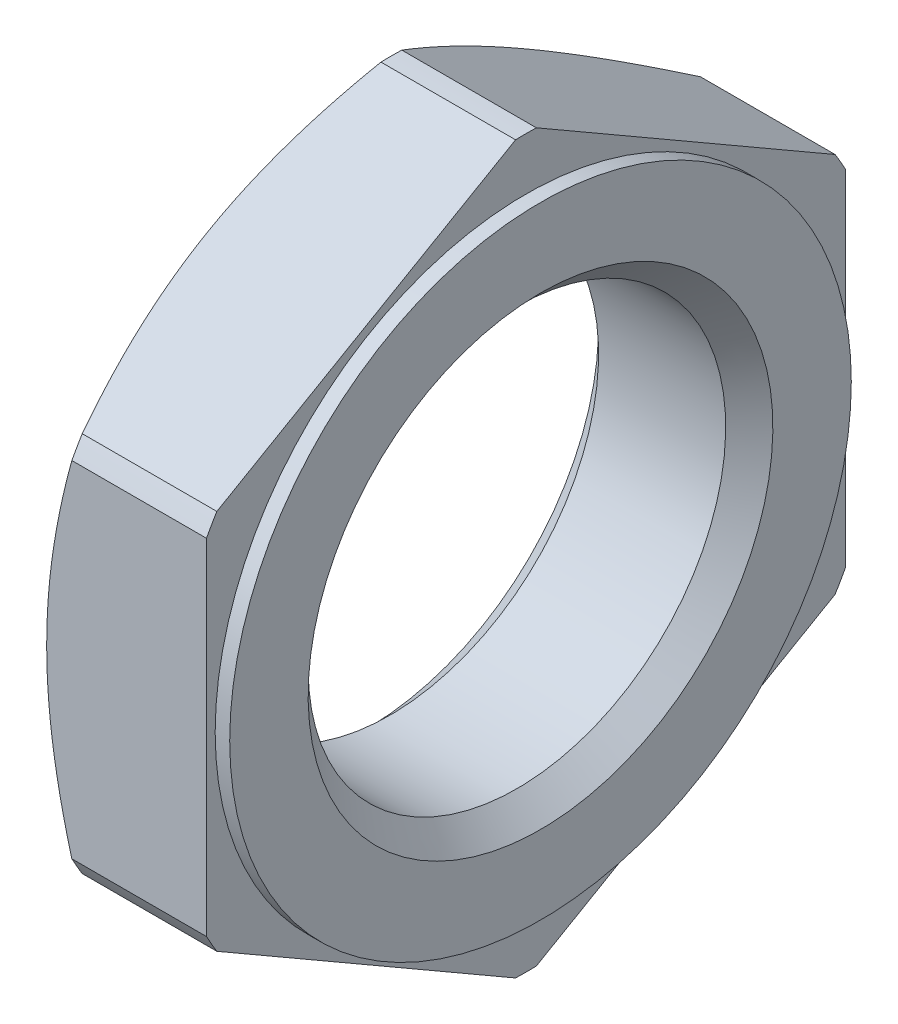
ISO-10303-21;
HEADER;
FILE_DESCRIPTION(('STEP AP214'),'2;1');
FILE_NAME('part.step','',(''),(''),'','','');
FILE_SCHEMA(('AUTOMOTIVE_DESIGN { 1 0 10303 214 1 1 1 1 }'));
ENDSEC;
DATA;
#1=APPLICATION_CONTEXT('core data for automotive mechanical design processes');
#2=APPLICATION_PROTOCOL_DEFINITION('international standard','automotive_design',2000,#1);
#3=PRODUCT_CONTEXT('',#1,'mechanical');
#4=PRODUCT('Part','Part','',(#3));
#5=PRODUCT_RELATED_PRODUCT_CATEGORY('part','',(#4));
#6=PRODUCT_DEFINITION_FORMATION('','',#4);
#7=PRODUCT_DEFINITION_CONTEXT('part definition',#1,'design');
#8=PRODUCT_DEFINITION('design','',#6,#7);
#9=PRODUCT_DEFINITION_SHAPE('','',#8);
#10=(LENGTH_UNIT() NAMED_UNIT(*) SI_UNIT(.MILLI.,.METRE.));
#11=(NAMED_UNIT(*) PLANE_ANGLE_UNIT() SI_UNIT($,.RADIAN.));
#12=(NAMED_UNIT(*) SI_UNIT($,.STERADIAN.) SOLID_ANGLE_UNIT());
#13=UNCERTAINTY_MEASURE_WITH_UNIT(LENGTH_MEASURE(1.E-05),#10,'distance_accuracy_value','');
#14=(GEOMETRIC_REPRESENTATION_CONTEXT(3) GLOBAL_UNCERTAINTY_ASSIGNED_CONTEXT((#13)) GLOBAL_UNIT_ASSIGNED_CONTEXT((#10,
#11,#12)) REPRESENTATION_CONTEXT('',''));
#15=CARTESIAN_POINT('',(0.,0.,0.));
#16=DIRECTION('',(0.,0.,1.));
#17=DIRECTION('',(1.,0.,0.));
#18=AXIS2_PLACEMENT_3D('',#15,#16,#17);
#19=CARTESIAN_POINT('',(6.,0.,0.));
#20=DIRECTION('',(-1.,0.,0.));
#21=DIRECTION('',(0.,0.,1.));
#22=AXIS2_PLACEMENT_3D('',#19,#20,#21);
#23=CYLINDRICAL_SURFACE('',#22,10.7);
#24=CARTESIAN_POINT('',(5.5,0.,0.));
#25=DIRECTION('',(-1.,0.,0.));
#26=DIRECTION('',(0.,0.,1.));
#27=AXIS2_PLACEMENT_3D('',#24,#25,#26);
#28=CIRCLE('',#27,10.7);
#29=CARTESIAN_POINT('',(5.5,0.,10.7));
#30=VERTEX_POINT('',#29);
#31=EDGE_CURVE('E382',#30,#30,#28,.F.);
#32=ORIENTED_EDGE('',*,*,#31,.T.);
#33=EDGE_LOOP('',(#32));
#34=FACE_BOUND('',#33,.T.);
#35=CARTESIAN_POINT('',(6.,0.,0.));
#36=DIRECTION('',(-1.,0.,0.));
#37=DIRECTION('',(0.,0.,1.));
#38=AXIS2_PLACEMENT_3D('',#35,#36,#37);
#39=CIRCLE('',#38,10.7);
#40=CARTESIAN_POINT('',(6.,0.,10.7));
#41=VERTEX_POINT('',#40);
#42=EDGE_CURVE('E20',#41,#41,#39,.T.);
#43=ORIENTED_EDGE('',*,*,#42,.T.);
#44=EDGE_LOOP('',(#43));
#45=FACE_BOUND('',#44,.T.);
#46=ADVANCED_FACE('F17',(#34,#45),#23,.T.);
#47=CARTESIAN_POINT('',(6.,10.7,0.));
#48=DIRECTION('',(-1.,0.,0.));
#49=DIRECTION('',(0.,0.,1.));
#50=AXIS2_PLACEMENT_3D('',#47,#48,#49);
#51=PLANE('',#50);
#52=CARTESIAN_POINT('',(6.,0.,0.));
#53=DIRECTION('',(1.,0.,0.));
#54=DIRECTION('',(0.,1.,0.));
#55=AXIS2_PLACEMENT_3D('',#52,#53,#54);
#56=CIRCLE('',#55,8.);
#57=CARTESIAN_POINT('',(6.,8.,0.));
#58=VERTEX_POINT('',#57);
#59=EDGE_CURVE('E377',#58,#58,#56,.F.);
#60=ORIENTED_EDGE('',*,*,#59,.T.);
#61=EDGE_LOOP('',(#60));
#62=FACE_BOUND('',#61,.T.);
#63=ORIENTED_EDGE('',*,*,#42,.F.);
#64=EDGE_LOOP('',(#63));
#65=FACE_BOUND('',#64,.T.);
#66=ADVANCED_FACE('F325',(#62,#65),#51,.F.);
#67=CARTESIAN_POINT('',(6.,0.,0.));
#68=DIRECTION('',(-1.,0.,0.));
#69=DIRECTION('',(0.,0.,1.));
#70=AXIS2_PLACEMENT_3D('',#67,#68,#69);
#71=CYLINDRICAL_SURFACE('',#70,12.5);
#72=CARTESIAN_POINT('',(0.866025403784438,0.,0.));
#73=DIRECTION('',(-1.,0.,0.));
#74=DIRECTION('',(0.,0.,1.));
#75=AXIS2_PLACEMENT_3D('',#72,#73,#74);
#76=CIRCLE('',#75,12.5);
#77=CARTESIAN_POINT('',(0.866025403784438,-12.4948649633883,0.358259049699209));
#78=VERTEX_POINT('',#77);
#79=CARTESIAN_POINT('',(0.866025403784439,-12.4948649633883,-0.35825904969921));
#80=VERTEX_POINT('',#79);
#81=EDGE_CURVE('E153',#78,#80,#76,.F.);
#82=ORIENTED_EDGE('',*,*,#81,.T.);
#83=DIRECTION('',(1.,0.,0.));
#84=VECTOR('',#83,1.);
#85=CARTESIAN_POINT('',(6.,-12.4948649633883,-0.358259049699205));
#86=LINE('',#85,#84);
#87=CARTESIAN_POINT('',(5.5,-12.4948649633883,-0.35825904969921));
#88=VERTEX_POINT('',#87);
#89=EDGE_CURVE('E156',#80,#88,#86,.T.);
#90=ORIENTED_EDGE('',*,*,#89,.T.);
#91=CARTESIAN_POINT('',(5.5,0.,0.));
#92=DIRECTION('',(-1.,0.,0.));
#93=DIRECTION('',(0.,0.,1.));
#94=AXIS2_PLACEMENT_3D('',#91,#92,#93);
#95=CIRCLE('',#94,12.5);
#96=CARTESIAN_POINT('',(5.5,-12.4948649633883,0.358259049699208));
#97=VERTEX_POINT('',#96);
#98=EDGE_CURVE('E389',#88,#97,#95,.T.);
#99=ORIENTED_EDGE('',*,*,#98,.T.);
#100=DIRECTION('',(1.,0.,0.));
#101=VECTOR('',#100,1.);
#102=CARTESIAN_POINT('',(6.,-12.4948649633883,0.358259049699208));
#103=LINE('',#102,#101);
#104=EDGE_CURVE('E160',#97,#78,#103,.F.);
#105=ORIENTED_EDGE('',*,*,#104,.T.);
#106=EDGE_LOOP('',(#82,#90,#99,#105));
#107=FACE_BOUND('',#106,.T.);
#108=ADVANCED_FACE('F322',(#107),#71,.T.);
#109=CARTESIAN_POINT('',(6.,0.,0.));
#110=DIRECTION('',(-1.,0.,0.));
#111=DIRECTION('',(0.,0.,1.));
#112=AXIS2_PLACEMENT_3D('',#109,#110,#111);
#113=CYLINDRICAL_SURFACE('',#112,12.5);
#114=CARTESIAN_POINT('',(0.866025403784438,0.,0.));
#115=DIRECTION('',(-1.,0.,0.));
#116=DIRECTION('',(0.,0.,1.));
#117=AXIS2_PLACEMENT_3D('',#114,#115,#116);
#118=CIRCLE('',#117,12.5);
#119=CARTESIAN_POINT('',(0.866025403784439,-6.55769391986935,-10.6417409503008));
#120=VERTEX_POINT('',#119);
#121=CARTESIAN_POINT('',(0.866025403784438,-5.93717104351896,-11.));
#122=VERTEX_POINT('',#121);
#123=EDGE_CURVE('E151',#120,#122,#118,.F.);
#124=ORIENTED_EDGE('',*,*,#123,.T.);
#125=DIRECTION('',(1.,0.,0.));
#126=VECTOR('',#125,1.);
#127=CARTESIAN_POINT('',(6.,-5.93717104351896,-11.));
#128=LINE('',#127,#126);
#129=CARTESIAN_POINT('',(5.5,-5.93717104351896,-11.));
#130=VERTEX_POINT('',#129);
#131=EDGE_CURVE('E143',#122,#130,#128,.T.);
#132=ORIENTED_EDGE('',*,*,#131,.T.);
#133=CARTESIAN_POINT('',(5.5,0.,0.));
#134=DIRECTION('',(-1.,0.,0.));
#135=DIRECTION('',(0.,0.,1.));
#136=AXIS2_PLACEMENT_3D('',#133,#134,#135);
#137=CIRCLE('',#136,12.5);
#138=CARTESIAN_POINT('',(5.5,-6.55769391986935,-10.6417409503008));
#139=VERTEX_POINT('',#138);
#140=EDGE_CURVE('E129',#130,#139,#137,.T.);
#141=ORIENTED_EDGE('',*,*,#140,.T.);
#142=DIRECTION('',(1.,0.,0.));
#143=VECTOR('',#142,1.);
#144=CARTESIAN_POINT('',(6.,-6.55769391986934,-10.6417409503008));
#145=LINE('',#144,#143);
#146=EDGE_CURVE('E145',#139,#120,#145,.F.);
#147=ORIENTED_EDGE('',*,*,#146,.T.);
#148=EDGE_LOOP('',(#124,#132,#141,#147));
#149=FACE_BOUND('',#148,.T.);
#150=ADVANCED_FACE('F319',(#149),#113,.T.);
#151=CARTESIAN_POINT('',(6.,0.,0.));
#152=DIRECTION('',(-1.,0.,0.));
#153=DIRECTION('',(0.,0.,1.));
#154=AXIS2_PLACEMENT_3D('',#151,#152,#153);
#155=CYLINDRICAL_SURFACE('',#154,12.5);
#156=CARTESIAN_POINT('',(0.866025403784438,0.,0.));
#157=DIRECTION('',(-1.,0.,0.));
#158=DIRECTION('',(0.,0.,1.));
#159=AXIS2_PLACEMENT_3D('',#156,#157,#158);
#160=CIRCLE('',#159,12.5);
#161=CARTESIAN_POINT('',(0.866025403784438,5.93717104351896,-11.));
#162=VERTEX_POINT('',#161);
#163=CARTESIAN_POINT('',(0.866025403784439,6.55769391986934,-10.6417409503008));
#164=VERTEX_POINT('',#163);
#165=EDGE_CURVE('E149',#162,#164,#160,.F.);
#166=ORIENTED_EDGE('',*,*,#165,.T.);
#167=DIRECTION('',(1.,0.,0.));
#168=VECTOR('',#167,1.);
#169=CARTESIAN_POINT('',(6.,6.55769391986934,-10.6417409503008));
#170=LINE('',#169,#168);
#171=CARTESIAN_POINT('',(5.5,6.55769391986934,-10.6417409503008));
#172=VERTEX_POINT('',#171);
#173=EDGE_CURVE('E128',#164,#172,#170,.T.);
#174=ORIENTED_EDGE('',*,*,#173,.T.);
#175=CARTESIAN_POINT('',(5.5,0.,0.));
#176=DIRECTION('',(-1.,0.,0.));
#177=DIRECTION('',(0.,0.,1.));
#178=AXIS2_PLACEMENT_3D('',#175,#176,#177);
#179=CIRCLE('',#178,12.5);
#180=CARTESIAN_POINT('',(5.5,5.93717104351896,-11.));
#181=VERTEX_POINT('',#180);
#182=EDGE_CURVE('E118',#172,#181,#179,.T.);
#183=ORIENTED_EDGE('',*,*,#182,.T.);
#184=DIRECTION('',(1.,0.,0.));
#185=VECTOR('',#184,1.);
#186=CARTESIAN_POINT('',(6.,5.93717104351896,-11.));
#187=LINE('',#186,#185);
#188=EDGE_CURVE('E125',#181,#162,#187,.F.);
#189=ORIENTED_EDGE('',*,*,#188,.T.);
#190=EDGE_LOOP('',(#166,#174,#183,#189));
#191=FACE_BOUND('',#190,.T.);
#192=ADVANCED_FACE('F124',(#191),#155,.T.);
#193=CARTESIAN_POINT('',(6.,0.,0.));
#194=DIRECTION('',(-1.,0.,0.));
#195=DIRECTION('',(0.,0.,1.));
#196=AXIS2_PLACEMENT_3D('',#193,#194,#195);
#197=CYLINDRICAL_SURFACE('',#196,12.5);
#198=CARTESIAN_POINT('',(5.5,0.,0.));
#199=DIRECTION('',(-1.,0.,0.));
#200=DIRECTION('',(0.,0.,1.));
#201=AXIS2_PLACEMENT_3D('',#198,#199,#200);
#202=CIRCLE('',#201,12.5);
#203=CARTESIAN_POINT('',(5.5,12.4948649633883,0.35825904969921));
#204=VERTEX_POINT('',#203);
#205=CARTESIAN_POINT('',(5.5,12.4948649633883,-0.358259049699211));
#206=VERTEX_POINT('',#205);
#207=EDGE_CURVE('E385',#204,#206,#202,.T.);
#208=ORIENTED_EDGE('',*,*,#207,.T.);
#209=DIRECTION('',(1.,0.,0.));
#210=VECTOR('',#209,1.);
#211=CARTESIAN_POINT('',(6.,12.4948649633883,-0.358259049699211));
#212=LINE('',#211,#210);
#213=CARTESIAN_POINT('',(0.866025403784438,12.4948649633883,-0.358259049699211));
#214=VERTEX_POINT('',#213);
#215=EDGE_CURVE('E414',#206,#214,#212,.F.);
#216=ORIENTED_EDGE('',*,*,#215,.T.);
#217=CARTESIAN_POINT('',(0.866025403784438,0.,0.));
#218=DIRECTION('',(-1.,0.,0.));
#219=DIRECTION('',(0.,0.,1.));
#220=AXIS2_PLACEMENT_3D('',#217,#218,#219);
#221=CIRCLE('',#220,12.5);
#222=CARTESIAN_POINT('',(0.866025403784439,12.4948649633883,0.35825904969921));
#223=VERTEX_POINT('',#222);
#224=EDGE_CURVE('E408',#214,#223,#221,.F.);
#225=ORIENTED_EDGE('',*,*,#224,.T.);
#226=DIRECTION('',(1.,0.,0.));
#227=VECTOR('',#226,1.);
#228=CARTESIAN_POINT('',(6.,12.4948649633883,0.358259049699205));
#229=LINE('',#228,#227);
#230=EDGE_CURVE('E412',#223,#204,#229,.T.);
#231=ORIENTED_EDGE('',*,*,#230,.T.);
#232=EDGE_LOOP('',(#208,#216,#225,#231));
#233=FACE_BOUND('',#232,.T.);
#234=ADVANCED_FACE('F312',(#233),#197,.T.);
#235=CARTESIAN_POINT('',(6.,0.,0.));
#236=DIRECTION('',(-1.,0.,0.));
#237=DIRECTION('',(0.,0.,1.));
#238=AXIS2_PLACEMENT_3D('',#235,#236,#237);
#239=CYLINDRICAL_SURFACE('',#238,12.5);
#240=CARTESIAN_POINT('',(0.866025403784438,0.,0.));
#241=DIRECTION('',(-1.,0.,0.));
#242=DIRECTION('',(0.,0.,1.));
#243=AXIS2_PLACEMENT_3D('',#240,#241,#242);
#244=CIRCLE('',#243,12.5);
#245=CARTESIAN_POINT('',(0.866025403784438,6.55769391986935,10.6417409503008));
#246=VERTEX_POINT('',#245);
#247=CARTESIAN_POINT('',(0.866025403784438,5.93717104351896,11.));
#248=VERTEX_POINT('',#247);
#249=EDGE_CURVE('E130',#246,#248,#244,.F.);
#250=ORIENTED_EDGE('',*,*,#249,.T.);
#251=DIRECTION('',(-1.,0.,0.));
#252=VECTOR('',#251,1.);
#253=CARTESIAN_POINT('',(6.,5.93717104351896,11.));
#254=LINE('',#253,#252);
#255=CARTESIAN_POINT('',(5.5,5.93717104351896,11.));
#256=VERTEX_POINT('',#255);
#257=EDGE_CURVE('E405',#248,#256,#254,.F.);
#258=ORIENTED_EDGE('',*,*,#257,.T.);
#259=CARTESIAN_POINT('',(5.5,0.,0.));
#260=DIRECTION('',(-1.,0.,0.));
#261=DIRECTION('',(0.,0.,1.));
#262=AXIS2_PLACEMENT_3D('',#259,#260,#261);
#263=CIRCLE('',#262,12.5);
#264=CARTESIAN_POINT('',(5.5,6.55769391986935,10.6417409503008));
#265=VERTEX_POINT('',#264);
#266=EDGE_CURVE('E387',#256,#265,#263,.T.);
#267=ORIENTED_EDGE('',*,*,#266,.T.);
#268=DIRECTION('',(1.,0.,0.));
#269=VECTOR('',#268,1.);
#270=CARTESIAN_POINT('',(6.,6.55769391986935,10.6417409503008));
#271=LINE('',#270,#269);
#272=EDGE_CURVE('E411',#265,#246,#271,.F.);
#273=ORIENTED_EDGE('',*,*,#272,.T.);
#274=EDGE_LOOP('',(#250,#258,#267,#273));
#275=FACE_BOUND('',#274,.T.);
#276=ADVANCED_FACE('F308',(#275),#239,.T.);
#277=CARTESIAN_POINT('',(5.5,12.5,0.));
#278=DIRECTION('',(-1.,0.,0.));
#279=DIRECTION('',(0.,0.,1.));
#280=AXIS2_PLACEMENT_3D('',#277,#278,#279);
#281=PLANE('',#280);
#282=ORIENTED_EDGE('',*,*,#31,.F.);
#283=EDGE_LOOP('',(#282));
#284=FACE_BOUND('',#283,.T.);
#285=DIRECTION('',(0.,0.5,-0.866025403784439));
#286=VECTOR('',#285,1.);
#287=CARTESIAN_POINT('',(5.5,12.7017059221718,0.));
#288=LINE('',#287,#286);
#289=EDGE_CURVE('E409',#204,#265,#288,.F.);
#290=ORIENTED_EDGE('',*,*,#289,.T.);
#291=ORIENTED_EDGE('',*,*,#266,.F.);
#292=DIRECTION('',(0.,1.,0.));
#293=VECTOR('',#292,1.);
#294=CARTESIAN_POINT('',(5.5,6.35085296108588,11.));
#295=LINE('',#294,#293);
#296=CARTESIAN_POINT('',(5.5,-5.93717104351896,11.));
#297=VERTEX_POINT('',#296);
#298=EDGE_CURVE('E402',#256,#297,#295,.F.);
#299=ORIENTED_EDGE('',*,*,#298,.T.);
#300=CARTESIAN_POINT('',(5.5,0.,0.));
#301=DIRECTION('',(-1.,0.,0.));
#302=DIRECTION('',(0.,0.,1.));
#303=AXIS2_PLACEMENT_3D('',#300,#301,#302);
#304=CIRCLE('',#303,12.5);
#305=CARTESIAN_POINT('',(5.5,-6.55769391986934,10.6417409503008));
#306=VERTEX_POINT('',#305);
#307=EDGE_CURVE('E380',#306,#297,#304,.T.);
#308=ORIENTED_EDGE('',*,*,#307,.F.);
#309=DIRECTION('',(0.,0.5,0.866025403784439));
#310=VECTOR('',#309,1.);
#311=CARTESIAN_POINT('',(5.5,-6.35085296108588,11.));
#312=LINE('',#311,#310);
#313=EDGE_CURVE('E158',#306,#97,#312,.F.);
#314=ORIENTED_EDGE('',*,*,#313,.T.);
#315=ORIENTED_EDGE('',*,*,#98,.F.);
#316=DIRECTION('',(0.,-0.5,0.866025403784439));
#317=VECTOR('',#316,1.);
#318=CARTESIAN_POINT('',(5.5,-12.7017059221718,0.));
#319=LINE('',#318,#317);
#320=EDGE_CURVE('E154',#88,#139,#319,.F.);
#321=ORIENTED_EDGE('',*,*,#320,.T.);
#322=ORIENTED_EDGE('',*,*,#140,.F.);
#323=DIRECTION('',(0.,1.,0.));
#324=VECTOR('',#323,1.);
#325=CARTESIAN_POINT('',(5.5,-6.35085296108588,-11.));
#326=LINE('',#325,#324);
#327=EDGE_CURVE('E135',#130,#181,#326,.T.);
#328=ORIENTED_EDGE('',*,*,#327,.T.);
#329=ORIENTED_EDGE('',*,*,#182,.F.);
#330=DIRECTION('',(0.,-0.5,-0.866025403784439));
#331=VECTOR('',#330,1.);
#332=CARTESIAN_POINT('',(5.5,6.35085296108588,-11.));
#333=LINE('',#332,#331);
#334=EDGE_CURVE('E413',#172,#206,#333,.F.);
#335=ORIENTED_EDGE('',*,*,#334,.T.);
#336=ORIENTED_EDGE('',*,*,#207,.F.);
#337=EDGE_LOOP('',(#290,#291,#299,#308,#314,#315,#321,#322,#328,#329,#335,#336));
#338=FACE_BOUND('',#337,.T.);
#339=ADVANCED_FACE('F141',(#284,#338),#281,.F.);
#340=CARTESIAN_POINT('',(6.,0.,0.));
#341=DIRECTION('',(-1.,0.,0.));
#342=DIRECTION('',(0.,0.,1.));
#343=AXIS2_PLACEMENT_3D('',#340,#341,#342);
#344=CYLINDRICAL_SURFACE('',#343,12.5);
#345=CARTESIAN_POINT('',(0.866025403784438,0.,0.));
#346=DIRECTION('',(-1.,0.,0.));
#347=DIRECTION('',(0.,0.,1.));
#348=AXIS2_PLACEMENT_3D('',#345,#346,#347);
#349=CIRCLE('',#348,12.5);
#350=CARTESIAN_POINT('',(0.866025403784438,-5.93717104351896,11.));
#351=VERTEX_POINT('',#350);
#352=CARTESIAN_POINT('',(0.866025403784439,-6.55769391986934,10.6417409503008));
#353=VERTEX_POINT('',#352);
#354=EDGE_CURVE('E379',#351,#353,#349,.F.);
#355=ORIENTED_EDGE('',*,*,#354,.T.);
#356=DIRECTION('',(1.,0.,0.));
#357=VECTOR('',#356,1.);
#358=CARTESIAN_POINT('',(6.,-6.55769391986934,10.6417409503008));
#359=LINE('',#358,#357);
#360=EDGE_CURVE('E161',#353,#306,#359,.T.);
#361=ORIENTED_EDGE('',*,*,#360,.T.);
#362=ORIENTED_EDGE('',*,*,#307,.T.);
#363=DIRECTION('',(-1.,0.,0.));
#364=VECTOR('',#363,1.);
#365=CARTESIAN_POINT('',(6.,-5.93717104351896,11.));
#366=LINE('',#365,#364);
#367=EDGE_CURVE('E371',#297,#351,#366,.T.);
#368=ORIENTED_EDGE('',*,*,#367,.T.);
#369=EDGE_LOOP('',(#355,#361,#362,#368));
#370=FACE_BOUND('',#369,.T.);
#371=ADVANCED_FACE('F301',(#370),#344,.T.);
#372=CARTESIAN_POINT('',(6.,0.,0.));
#373=DIRECTION('',(1.,0.,0.));
#374=DIRECTION('',(0.,1.,0.));
#375=AXIS2_PLACEMENT_3D('',#372,#373,#374);
#376=CONICAL_SURFACE('',#375,8.,0.785398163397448);
#377=CARTESIAN_POINT('',(5.188,0.,0.));
#378=DIRECTION('',(-1.,0.,0.));
#379=DIRECTION('',(0.,0.,1.));
#380=AXIS2_PLACEMENT_3D('',#377,#378,#379);
#381=CIRCLE('',#380,7.188);
#382=CARTESIAN_POINT('',(5.188,0.,7.188));
#383=VERTEX_POINT('',#382);
#384=EDGE_CURVE('E368',#383,#383,#381,.T.);
#385=ORIENTED_EDGE('',*,*,#384,.T.);
#386=EDGE_LOOP('',(#385));
#387=FACE_BOUND('',#386,.T.);
#388=ORIENTED_EDGE('',*,*,#59,.F.);
#389=EDGE_LOOP('',(#388));
#390=FACE_BOUND('',#389,.T.);
#391=ADVANCED_FACE('F296',(#387,#390),#376,.F.);
#392=CARTESIAN_POINT('',(6.,-6.35085296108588,11.));
#393=DIRECTION('',(0.,0.866025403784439,-0.5));
#394=DIRECTION('',(0.,0.5,0.866025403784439));
#395=AXIS2_PLACEMENT_3D('',#392,#393,#394);
#396=PLANE('',#395);
#397=ORIENTED_EDGE('',*,*,#313,.F.);
#398=ORIENTED_EDGE('',*,*,#360,.F.);
#399=CARTESIAN_POINT('',(0.,-9.52627944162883,5.49999999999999));
#400=CARTESIAN_POINT('',(-3.41932240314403E-05,-9.40053234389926,5.71780036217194));
#401=CARTESIAN_POINT('',(0.00497877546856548,-9.27479037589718,5.93559183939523));
#402=CARTESIAN_POINT('',(0.0248453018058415,-9.02351913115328,6.37080640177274));
#403=CARTESIAN_POINT('',(0.0396973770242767,-8.89798982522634,6.58822953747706));
#404=CARTESIAN_POINT('',(0.078899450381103,-8.64787663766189,7.02143828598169));
#405=CARTESIAN_POINT('',(0.103206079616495,-8.52329104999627,7.23722685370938));
#406=CARTESIAN_POINT('',(0.160853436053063,-8.27464923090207,7.66788711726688));
#407=CARTESIAN_POINT('',(0.194194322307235,-8.15059300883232,7.88275879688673));
#408=CARTESIAN_POINT('',(0.306868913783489,-7.7796315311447,8.52528292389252));
#409=CARTESIAN_POINT('',(0.398898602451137,-7.53366639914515,8.95130702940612));
#410=CARTESIAN_POINT('',(0.558591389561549,-7.16655690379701,9.58715932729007));
#411=CARTESIAN_POINT('',(0.615593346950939,-7.04420210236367,9.79908405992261));
#412=CARTESIAN_POINT('',(0.736100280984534,-6.80033131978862,10.2214806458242));
#413=CARTESIAN_POINT('',(0.799603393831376,-6.67881510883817,10.4319528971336));
#414=CARTESIAN_POINT('',(0.866025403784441,-6.55769391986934,10.6417409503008));
#415=B_SPLINE_CURVE_WITH_KNOTS('',3,(#399,#400,#401,#402,#403,#404,#405,#406,#407,#408,#409,
#410,#411,#412,#413,#414),.UNSPECIFIED.,.F.,.F.,(4,2,2,2,2,2,2,4),(0.,0.754415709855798,
1.50871778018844,2.25959984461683,3.01049512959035,4.51068137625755,5.26440004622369,
6.01790323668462),.UNSPECIFIED.);
#416=CARTESIAN_POINT('',(0.,-9.52627944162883,5.49999999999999));
#417=VERTEX_POINT('',#416);
#418=EDGE_CURVE('E287',#417,#353,#415,.T.);
#419=ORIENTED_EDGE('',*,*,#418,.F.);
#420=CARTESIAN_POINT('',(0.866025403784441,-12.4948649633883,0.358259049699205));
#421=CARTESIAN_POINT('',(0.799603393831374,-12.3737437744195,0.568047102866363));
#422=CARTESIAN_POINT('',(0.736100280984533,-12.252227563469,0.778519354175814));
#423=CARTESIAN_POINT('',(0.615593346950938,-12.008356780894,1.20091594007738));
#424=CARTESIAN_POINT('',(0.558591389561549,-11.8860019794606,1.41284067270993));
#425=CARTESIAN_POINT('',(0.398898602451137,-11.5188924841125,2.04869297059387));
#426=CARTESIAN_POINT('',(0.306868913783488,-11.2729273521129,2.47471707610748));
#427=CARTESIAN_POINT('',(0.194194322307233,-10.9019658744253,3.11724120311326));
#428=CARTESIAN_POINT('',(0.160853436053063,-10.7779096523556,3.33211288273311));
#429=CARTESIAN_POINT('',(0.103206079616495,-10.5292678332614,3.76277314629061));
#430=CARTESIAN_POINT('',(0.0788994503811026,-10.4046822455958,3.9785617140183));
#431=CARTESIAN_POINT('',(0.0396973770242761,-10.1545690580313,4.41177046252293));
#432=CARTESIAN_POINT('',(0.0248453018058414,-10.0290397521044,4.62919359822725));
#433=CARTESIAN_POINT('',(0.00497877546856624,-9.77776850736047,5.06440816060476));
#434=CARTESIAN_POINT('',(-3.41932240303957E-05,-9.6520265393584,5.28219963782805));
#435=CARTESIAN_POINT('',(0.,-9.52627944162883,5.49999999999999));
#436=B_SPLINE_CURVE_WITH_KNOTS('',3,(#420,#421,#422,#423,#424,#425,#426,#427,#428,#429,#430,
#431,#432,#433,#434,#435),.UNSPECIFIED.,.F.,.F.,(4,2,2,2,2,2,2,4),(0.,0.753503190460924,
1.50722186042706,3.00740810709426,3.75830339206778,4.50918545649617,5.26348752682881,
6.01790323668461),.UNSPECIFIED.);
#437=EDGE_CURVE('E282',#78,#417,#436,.T.);
#438=ORIENTED_EDGE('',*,*,#437,.F.);
#439=ORIENTED_EDGE('',*,*,#104,.F.);
#440=EDGE_LOOP('',(#397,#398,#419,#438,#439));
#441=FACE_BOUND('',#440,.T.);
#442=ADVANCED_FACE('F292',(#441),#396,.F.);
#443=CARTESIAN_POINT('',(6.,-12.7017059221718,0.));
#444=DIRECTION('',(0.,0.866025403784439,0.5));
#445=DIRECTION('',(0.,-0.5,0.866025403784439));
#446=AXIS2_PLACEMENT_3D('',#443,#444,#445);
#447=PLANE('',#446);
#448=ORIENTED_EDGE('',*,*,#320,.F.);
#449=ORIENTED_EDGE('',*,*,#89,.F.);
#450=CARTESIAN_POINT('',(0.,-9.52627944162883,-5.49999999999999));
#451=CARTESIAN_POINT('',(-3.41932240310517E-05,-9.6520265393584,-5.28219963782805));
#452=CARTESIAN_POINT('',(0.00497877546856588,-9.77776850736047,-5.06440816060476));
#453=CARTESIAN_POINT('',(0.0248453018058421,-10.0290397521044,-4.62919359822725));
#454=CARTESIAN_POINT('',(0.0396973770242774,-10.1545690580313,-4.41177046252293));
#455=CARTESIAN_POINT('',(0.0788994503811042,-10.4046822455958,-3.9785617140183));
#456=CARTESIAN_POINT('',(0.103206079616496,-10.5292678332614,-3.76277314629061));
#457=CARTESIAN_POINT('',(0.160853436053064,-10.7779096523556,-3.33211288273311));
#458=CARTESIAN_POINT('',(0.194194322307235,-10.9019658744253,-3.11724120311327));
#459=CARTESIAN_POINT('',(0.306868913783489,-11.2729273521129,-2.47471707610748));
#460=CARTESIAN_POINT('',(0.398898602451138,-11.5188924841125,-2.04869297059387));
#461=CARTESIAN_POINT('',(0.55859138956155,-11.8860019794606,-1.41284067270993));
#462=CARTESIAN_POINT('',(0.615593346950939,-12.008356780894,-1.20091594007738));
#463=CARTESIAN_POINT('',(0.736100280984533,-12.252227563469,-0.778519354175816));
#464=CARTESIAN_POINT('',(0.799603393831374,-12.3737437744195,-0.568047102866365));
#465=CARTESIAN_POINT('',(0.866025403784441,-12.4948649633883,-0.358259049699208));
#466=B_SPLINE_CURVE_WITH_KNOTS('',3,(#450,#451,#452,#453,#454,#455,#456,#457,#458,#459,#460,
#461,#462,#463,#464,#465),.UNSPECIFIED.,.F.,.F.,(4,2,2,2,2,2,2,4),(0.,0.754415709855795,
1.50871778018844,2.25959984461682,3.01049512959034,4.51068137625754,5.26440004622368,
6.01790323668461),.UNSPECIFIED.);
#467=CARTESIAN_POINT('',(0.,-9.52627944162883,-5.49999999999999));
#468=VERTEX_POINT('',#467);
#469=EDGE_CURVE('E277',#468,#80,#466,.T.);
#470=ORIENTED_EDGE('',*,*,#469,.F.);
#471=CARTESIAN_POINT('',(0.866025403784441,-6.55769391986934,-10.6417409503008));
#472=CARTESIAN_POINT('',(0.799603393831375,-6.67881510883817,-10.4319528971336));
#473=CARTESIAN_POINT('',(0.736100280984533,-6.80033131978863,-10.2214806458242));
#474=CARTESIAN_POINT('',(0.615593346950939,-7.04420210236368,-9.79908405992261));
#475=CARTESIAN_POINT('',(0.55859138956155,-7.16655690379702,-9.58715932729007));
#476=CARTESIAN_POINT('',(0.398898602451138,-7.53366639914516,-8.95130702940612));
#477=CARTESIAN_POINT('',(0.306868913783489,-7.77963153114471,-8.52528292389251));
#478=CARTESIAN_POINT('',(0.194194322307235,-8.15059300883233,-7.88275879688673));
#479=CARTESIAN_POINT('',(0.160853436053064,-8.27464923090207,-7.66788711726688));
#480=CARTESIAN_POINT('',(0.103206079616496,-8.52329104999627,-7.23722685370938));
#481=CARTESIAN_POINT('',(0.0788994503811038,-8.6478766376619,-7.02143828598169));
#482=CARTESIAN_POINT('',(0.0396973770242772,-8.89798982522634,-6.58822953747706));
#483=CARTESIAN_POINT('',(0.0248453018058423,-9.02351913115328,-6.37080640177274));
#484=CARTESIAN_POINT('',(0.00497877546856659,-9.27479037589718,-5.93559183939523));
#485=CARTESIAN_POINT('',(-3.41932240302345E-05,-9.40053234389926,-5.71780036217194));
#486=CARTESIAN_POINT('',(0.,-9.52627944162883,-5.49999999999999));
#487=B_SPLINE_CURVE_WITH_KNOTS('',3,(#471,#472,#473,#474,#475,#476,#477,#478,#479,#480,#481,
#482,#483,#484,#485,#486),.UNSPECIFIED.,.F.,.F.,(4,2,2,2,2,2,2,4),(0.,0.753503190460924,
1.50722186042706,3.00740810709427,3.75830339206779,4.50918545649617,5.26348752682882,
6.01790323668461),.UNSPECIFIED.);
#488=EDGE_CURVE('E258',#120,#468,#487,.T.);
#489=ORIENTED_EDGE('',*,*,#488,.F.);
#490=ORIENTED_EDGE('',*,*,#146,.F.);
#491=EDGE_LOOP('',(#448,#449,#470,#489,#490));
#492=FACE_BOUND('',#491,.T.);
#493=ADVANCED_FACE('F244',(#492),#447,.F.);
#494=CARTESIAN_POINT('',(6.,-6.35085296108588,-11.));
#495=DIRECTION('',(0.,0.,1.));
#496=DIRECTION('',(1.,0.,0.));
#497=AXIS2_PLACEMENT_3D('',#494,#495,#496);
#498=PLANE('',#497);
#499=ORIENTED_EDGE('',*,*,#327,.F.);
#500=ORIENTED_EDGE('',*,*,#131,.F.);
#501=CARTESIAN_POINT('',(0.,0.,-11.));
#502=CARTESIAN_POINT('',(-3.4193224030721E-05,-0.251494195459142,-11.));
#503=CARTESIAN_POINT('',(0.00497877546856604,-0.502978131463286,-11.));
#504=CARTESIAN_POINT('',(0.0248453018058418,-1.00552062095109,-11.));
#505=CARTESIAN_POINT('',(0.0396973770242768,-1.25657923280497,-11.));
#506=CARTESIAN_POINT('',(0.0788994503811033,-1.75680560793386,-11.));
#507=CARTESIAN_POINT('',(0.103206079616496,-2.00597678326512,-11.));
#508=CARTESIAN_POINT('',(0.160853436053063,-2.50326042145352,-11.));
#509=CARTESIAN_POINT('',(0.194194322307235,-2.751372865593,-11.));
#510=CARTESIAN_POINT('',(0.306868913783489,-3.49329582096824,-11.));
#511=CARTESIAN_POINT('',(0.398898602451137,-3.98522608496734,-11.));
#512=CARTESIAN_POINT('',(0.558591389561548,-4.71944507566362,-11.));
#513=CARTESIAN_POINT('',(0.615593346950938,-4.9641546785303,-11.));
#514=CARTESIAN_POINT('',(0.736100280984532,-5.45189624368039,-11.));
#515=CARTESIAN_POINT('',(0.799603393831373,-5.69492866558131,-11.));
#516=CARTESIAN_POINT('',(0.866025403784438,-5.93717104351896,-11.));
#517=B_SPLINE_CURVE_WITH_KNOTS('',3,(#501,#502,#503,#504,#505,#506,#507,#508,#509,#510,#511,
#512,#513,#514,#515,#516),.UNSPECIFIED.,.F.,.F.,(4,2,2,2,2,2,2,4),(0.,0.754415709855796,
1.50871778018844,2.25959984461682,3.01049512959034,4.51068137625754,5.26440004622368,
6.0179032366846),.UNSPECIFIED.);
#518=CARTESIAN_POINT('',(0.,0.,-11.));
#519=VERTEX_POINT('',#518);
#520=EDGE_CURVE('E252',#519,#122,#517,.T.);
#521=ORIENTED_EDGE('',*,*,#520,.F.);
#522=CARTESIAN_POINT('',(0.866025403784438,5.93717104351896,-11.));
#523=CARTESIAN_POINT('',(0.799603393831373,5.69492866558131,-11.));
#524=CARTESIAN_POINT('',(0.736100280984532,5.45189624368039,-11.));
#525=CARTESIAN_POINT('',(0.615593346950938,4.9641546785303,-11.));
#526=CARTESIAN_POINT('',(0.558591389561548,4.71944507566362,-11.));
#527=CARTESIAN_POINT('',(0.398898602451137,3.98522608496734,-11.));
#528=CARTESIAN_POINT('',(0.306868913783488,3.49329582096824,-11.));
#529=CARTESIAN_POINT('',(0.194194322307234,2.751372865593,-11.));
#530=CARTESIAN_POINT('',(0.160853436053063,2.50326042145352,-11.));
#531=CARTESIAN_POINT('',(0.103206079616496,2.00597678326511,-11.));
#532=CARTESIAN_POINT('',(0.0788994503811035,1.75680560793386,-11.));
#533=CARTESIAN_POINT('',(0.039697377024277,1.25657923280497,-11.));
#534=CARTESIAN_POINT('',(0.0248453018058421,1.00552062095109,-11.));
#535=CARTESIAN_POINT('',(0.00497877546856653,0.502978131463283,-11.));
#536=CARTESIAN_POINT('',(-3.41932240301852E-05,0.251494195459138,-11.));
#537=CARTESIAN_POINT('',(0.,0.,-11.));
#538=B_SPLINE_CURVE_WITH_KNOTS('',3,(#522,#523,#524,#525,#526,#527,#528,#529,#530,#531,#532,
#533,#534,#535,#536,#537),.UNSPECIFIED.,.F.,.F.,(4,2,2,2,2,2,2,4),(0.,0.753503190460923,
1.50722186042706,3.00740810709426,3.75830339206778,4.50918545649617,5.26348752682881,
6.01790323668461),.UNSPECIFIED.);
#539=EDGE_CURVE('E138',#162,#519,#538,.T.);
#540=ORIENTED_EDGE('',*,*,#539,.F.);
#541=ORIENTED_EDGE('',*,*,#188,.F.);
#542=EDGE_LOOP('',(#499,#500,#521,#540,#541));
#543=FACE_BOUND('',#542,.T.);
#544=ADVANCED_FACE('F133',(#543),#498,.F.);
#545=CARTESIAN_POINT('',(6.,6.35085296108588,-11.));
#546=DIRECTION('',(0.,-0.866025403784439,0.5));
#547=DIRECTION('',(0.,-0.5,-0.866025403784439));
#548=AXIS2_PLACEMENT_3D('',#545,#546,#547);
#549=PLANE('',#548);
#550=ORIENTED_EDGE('',*,*,#334,.F.);
#551=ORIENTED_EDGE('',*,*,#173,.F.);
#552=CARTESIAN_POINT('',(0.,9.52627944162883,-5.5));
#553=CARTESIAN_POINT('',(-3.41932240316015E-05,9.40053234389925,-5.71780036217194));
#554=CARTESIAN_POINT('',(0.004978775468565,9.27479037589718,-5.93559183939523));
#555=CARTESIAN_POINT('',(0.0248453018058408,9.02351913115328,-6.37080640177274));
#556=CARTESIAN_POINT('',(0.039697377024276,8.89798982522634,-6.58822953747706));
#557=CARTESIAN_POINT('',(0.0788994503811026,8.64787663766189,-7.02143828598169));
#558=CARTESIAN_POINT('',(0.103206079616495,8.52329104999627,-7.23722685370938));
#559=CARTESIAN_POINT('',(0.160853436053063,8.27464923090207,-7.66788711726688));
#560=CARTESIAN_POINT('',(0.194194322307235,8.15059300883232,-7.88275879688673));
#561=CARTESIAN_POINT('',(0.30686891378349,7.7796315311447,-8.52528292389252));
#562=CARTESIAN_POINT('',(0.398898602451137,7.53366639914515,-8.95130702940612));
#563=CARTESIAN_POINT('',(0.55859138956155,7.16655690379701,-9.58715932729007));
#564=CARTESIAN_POINT('',(0.61559334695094,7.04420210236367,-9.79908405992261));
#565=CARTESIAN_POINT('',(0.736100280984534,6.80033131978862,-10.2214806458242));
#566=CARTESIAN_POINT('',(0.799603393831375,6.67881510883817,-10.4319528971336));
#567=CARTESIAN_POINT('',(0.86602540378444,6.55769391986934,-10.6417409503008));
#568=B_SPLINE_CURVE_WITH_KNOTS('',3,(#552,#553,#554,#555,#556,#557,#558,#559,#560,#561,#562,
#563,#564,#565,#566,#567),.UNSPECIFIED.,.F.,.F.,(4,2,2,2,2,2,2,4),(0.,0.754415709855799,
1.50871778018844,2.25959984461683,3.01049512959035,4.51068137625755,5.26440004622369,
6.01790323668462),.UNSPECIFIED.);
#569=CARTESIAN_POINT('',(0.,9.52627944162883,-5.5));
#570=VERTEX_POINT('',#569);
#571=EDGE_CURVE('E225',#570,#164,#568,.T.);
#572=ORIENTED_EDGE('',*,*,#571,.F.);
#573=CARTESIAN_POINT('',(0.86602540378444,12.4948649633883,-0.358259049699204));
#574=CARTESIAN_POINT('',(0.799603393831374,12.3737437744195,-0.568047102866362));
#575=CARTESIAN_POINT('',(0.736100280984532,12.252227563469,-0.778519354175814));
#576=CARTESIAN_POINT('',(0.615593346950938,12.008356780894,-1.20091594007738));
#577=CARTESIAN_POINT('',(0.558591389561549,11.8860019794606,-1.41284067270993));
#578=CARTESIAN_POINT('',(0.398898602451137,11.5188924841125,-2.04869297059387));
#579=CARTESIAN_POINT('',(0.306868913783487,11.2729273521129,-2.47471707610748));
#580=CARTESIAN_POINT('',(0.194194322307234,10.9019658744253,-3.11724120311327));
#581=CARTESIAN_POINT('',(0.160853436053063,10.7779096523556,-3.33211288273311));
#582=CARTESIAN_POINT('',(0.103206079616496,10.5292678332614,-3.76277314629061));
#583=CARTESIAN_POINT('',(0.0788994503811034,10.4046822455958,-3.9785617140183));
#584=CARTESIAN_POINT('',(0.0396973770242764,10.1545690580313,-4.41177046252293));
#585=CARTESIAN_POINT('',(0.0248453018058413,10.0290397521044,-4.62919359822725));
#586=CARTESIAN_POINT('',(0.00497877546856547,9.77776850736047,-5.06440816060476));
#587=CARTESIAN_POINT('',(-3.41932240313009E-05,9.6520265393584,-5.28219963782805));
#588=CARTESIAN_POINT('',(0.,9.52627944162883,-5.5));
#589=B_SPLINE_CURVE_WITH_KNOTS('',3,(#573,#574,#575,#576,#577,#578,#579,#580,#581,#582,#583,
#584,#585,#586,#587,#588),.UNSPECIFIED.,.F.,.F.,(4,2,2,2,2,2,2,4),(0.,0.753503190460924,
1.50722186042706,3.00740810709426,3.75830339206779,4.50918545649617,5.26348752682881,
6.01790323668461),.UNSPECIFIED.);
#590=EDGE_CURVE('E213',#214,#570,#589,.T.);
#591=ORIENTED_EDGE('',*,*,#590,.F.);
#592=ORIENTED_EDGE('',*,*,#215,.F.);
#593=EDGE_LOOP('',(#550,#551,#572,#591,#592));
#594=FACE_BOUND('',#593,.T.);
#595=ADVANCED_FACE('F233',(#594),#549,.F.);
#596=CARTESIAN_POINT('',(6.,12.7017059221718,0.));
#597=DIRECTION('',(0.,-0.866025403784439,-0.5));
#598=DIRECTION('',(0.,0.5,-0.866025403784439));
#599=AXIS2_PLACEMENT_3D('',#596,#597,#598);
#600=PLANE('',#599);
#601=ORIENTED_EDGE('',*,*,#289,.F.);
#602=ORIENTED_EDGE('',*,*,#230,.F.);
#603=CARTESIAN_POINT('',(0.,9.52627944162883,5.5));
#604=CARTESIAN_POINT('',(-3.41932240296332E-05,9.6520265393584,5.28219963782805));
#605=CARTESIAN_POINT('',(0.00497877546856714,9.77776850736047,5.06440816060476));
#606=CARTESIAN_POINT('',(0.0248453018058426,10.0290397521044,4.62919359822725));
#607=CARTESIAN_POINT('',(0.0396973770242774,10.1545690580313,4.41177046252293));
#608=CARTESIAN_POINT('',(0.0788994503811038,10.4046822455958,3.97856171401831));
#609=CARTESIAN_POINT('',(0.103206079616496,10.5292678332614,3.76277314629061));
#610=CARTESIAN_POINT('',(0.160853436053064,10.7779096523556,3.33211288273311));
#611=CARTESIAN_POINT('',(0.194194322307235,10.9019658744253,3.11724120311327));
#612=CARTESIAN_POINT('',(0.30686891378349,11.2729273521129,2.47471707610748));
#613=CARTESIAN_POINT('',(0.398898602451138,11.5188924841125,2.04869297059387));
#614=CARTESIAN_POINT('',(0.558591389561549,11.8860019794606,1.41284067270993));
#615=CARTESIAN_POINT('',(0.615593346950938,12.008356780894,1.20091594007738));
#616=CARTESIAN_POINT('',(0.736100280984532,12.252227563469,0.778519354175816));
#617=CARTESIAN_POINT('',(0.799603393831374,12.3737437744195,0.568047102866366));
#618=CARTESIAN_POINT('',(0.86602540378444,12.4948649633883,0.358259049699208));
#619=B_SPLINE_CURVE_WITH_KNOTS('',3,(#603,#604,#605,#606,#607,#608,#609,#610,#611,#612,#613,
#614,#615,#616,#617,#618),.UNSPECIFIED.,.F.,.F.,(4,2,2,2,2,2,2,4),(0.,0.754415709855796,
1.50871778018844,2.25959984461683,3.01049512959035,4.51068137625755,5.26440004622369,
6.01790323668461),.UNSPECIFIED.);
#620=CARTESIAN_POINT('',(0.,9.52627944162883,5.5));
#621=VERTEX_POINT('',#620);
#622=EDGE_CURVE('E219',#621,#223,#619,.T.);
#623=ORIENTED_EDGE('',*,*,#622,.F.);
#624=CARTESIAN_POINT('',(0.866025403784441,6.55769391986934,10.6417409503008));
#625=CARTESIAN_POINT('',(0.799603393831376,6.67881510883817,10.4319528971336));
#626=CARTESIAN_POINT('',(0.736100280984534,6.80033131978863,10.2214806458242));
#627=CARTESIAN_POINT('',(0.61559334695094,7.04420210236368,9.79908405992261));
#628=CARTESIAN_POINT('',(0.55859138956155,7.16655690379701,9.58715932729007));
#629=CARTESIAN_POINT('',(0.398898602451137,7.53366639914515,8.95130702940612));
#630=CARTESIAN_POINT('',(0.306868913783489,7.7796315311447,8.52528292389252));
#631=CARTESIAN_POINT('',(0.194194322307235,8.15059300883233,7.88275879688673));
#632=CARTESIAN_POINT('',(0.160853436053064,8.27464923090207,7.66788711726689));
#633=CARTESIAN_POINT('',(0.103206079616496,8.52329104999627,7.23722685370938));
#634=CARTESIAN_POINT('',(0.0788994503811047,8.64787663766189,7.02143828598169));
#635=CARTESIAN_POINT('',(0.0396973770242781,8.89798982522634,6.58822953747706));
#636=CARTESIAN_POINT('',(0.0248453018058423,9.02351913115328,6.37080640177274));
#637=CARTESIAN_POINT('',(0.00497877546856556,9.27479037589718,5.93559183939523));
#638=CARTESIAN_POINT('',(-3.41932240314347E-05,9.40053234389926,5.71780036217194));
#639=CARTESIAN_POINT('',(0.,9.52627944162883,5.5));
#640=B_SPLINE_CURVE_WITH_KNOTS('',3,(#624,#625,#626,#627,#628,#629,#630,#631,#632,#633,#634,
#635,#636,#637,#638,#639),.UNSPECIFIED.,.F.,.F.,(4,2,2,2,2,2,2,4),(0.,0.753503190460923,
1.50722186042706,3.00740810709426,3.75830339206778,4.50918545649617,5.26348752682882,
6.01790323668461),.UNSPECIFIED.);
#641=EDGE_CURVE('E35',#246,#621,#640,.T.);
#642=ORIENTED_EDGE('',*,*,#641,.F.);
#643=ORIENTED_EDGE('',*,*,#272,.F.);
#644=EDGE_LOOP('',(#601,#602,#623,#642,#643));
#645=FACE_BOUND('',#644,.T.);
#646=ADVANCED_FACE('F230',(#645),#600,.F.);
#647=CARTESIAN_POINT('',(6.,6.35085296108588,11.));
#648=DIRECTION('',(0.,0.,-1.));
#649=DIRECTION('',(-1.,0.,0.));
#650=AXIS2_PLACEMENT_3D('',#647,#648,#649);
#651=PLANE('',#650);
#652=ORIENTED_EDGE('',*,*,#298,.F.);
#653=ORIENTED_EDGE('',*,*,#257,.F.);
#654=CARTESIAN_POINT('',(0.,0.,11.));
#655=CARTESIAN_POINT('',(-3.41932240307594E-05,0.251494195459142,11.));
#656=CARTESIAN_POINT('',(0.00497877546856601,0.502978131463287,11.));
#657=CARTESIAN_POINT('',(0.0248453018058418,1.00552062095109,11.));
#658=CARTESIAN_POINT('',(0.0396973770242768,1.25657923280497,11.));
#659=CARTESIAN_POINT('',(0.0788994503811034,1.75680560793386,11.));
#660=CARTESIAN_POINT('',(0.103206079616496,2.00597678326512,11.));
#661=CARTESIAN_POINT('',(0.160853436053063,2.50326042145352,11.));
#662=CARTESIAN_POINT('',(0.194194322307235,2.751372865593,11.));
#663=CARTESIAN_POINT('',(0.306868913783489,3.49329582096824,11.));
#664=CARTESIAN_POINT('',(0.398898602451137,3.98522608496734,11.));
#665=CARTESIAN_POINT('',(0.558591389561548,4.71944507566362,11.));
#666=CARTESIAN_POINT('',(0.615593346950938,4.9641546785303,11.));
#667=CARTESIAN_POINT('',(0.736100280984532,5.4518962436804,11.));
#668=CARTESIAN_POINT('',(0.799603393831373,5.69492866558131,11.));
#669=CARTESIAN_POINT('',(0.866025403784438,5.93717104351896,11.));
#670=B_SPLINE_CURVE_WITH_KNOTS('',3,(#654,#655,#656,#657,#658,#659,#660,#661,#662,#663,#664,
#665,#666,#667,#668,#669),.UNSPECIFIED.,.F.,.F.,(4,2,2,2,2,2,2,4),(0.,0.754415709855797,
1.50871778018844,2.25959984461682,3.01049512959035,4.51068137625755,5.26440004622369,
6.01790323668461),.UNSPECIFIED.);
#671=CARTESIAN_POINT('',(0.,0.,11.));
#672=VERTEX_POINT('',#671);
#673=EDGE_CURVE('E180',#672,#248,#670,.T.);
#674=ORIENTED_EDGE('',*,*,#673,.F.);
#675=CARTESIAN_POINT('',(0.866025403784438,-5.93717104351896,11.));
#676=CARTESIAN_POINT('',(0.799603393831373,-5.69492866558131,11.));
#677=CARTESIAN_POINT('',(0.736100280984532,-5.45189624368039,11.));
#678=CARTESIAN_POINT('',(0.615593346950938,-4.9641546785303,11.));
#679=CARTESIAN_POINT('',(0.558591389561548,-4.71944507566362,11.));
#680=CARTESIAN_POINT('',(0.398898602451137,-3.98522608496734,11.));
#681=CARTESIAN_POINT('',(0.306868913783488,-3.49329582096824,11.));
#682=CARTESIAN_POINT('',(0.194194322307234,-2.751372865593,11.));
#683=CARTESIAN_POINT('',(0.160853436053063,-2.50326042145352,11.));
#684=CARTESIAN_POINT('',(0.103206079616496,-2.00597678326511,11.));
#685=CARTESIAN_POINT('',(0.0788994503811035,-1.75680560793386,11.));
#686=CARTESIAN_POINT('',(0.039697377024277,-1.25657923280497,11.));
#687=CARTESIAN_POINT('',(0.0248453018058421,-1.00552062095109,11.));
#688=CARTESIAN_POINT('',(0.00497877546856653,-0.502978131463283,11.));
#689=CARTESIAN_POINT('',(-3.41932240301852E-05,-0.251494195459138,11.));
#690=CARTESIAN_POINT('',(0.,0.,11.));
#691=B_SPLINE_CURVE_WITH_KNOTS('',3,(#675,#676,#677,#678,#679,#680,#681,#682,#683,#684,#685,
#686,#687,#688,#689,#690),.UNSPECIFIED.,.F.,.F.,(4,2,2,2,2,2,2,4),(0.,0.753503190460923,
1.50722186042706,3.00740810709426,3.75830339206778,4.50918545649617,5.26348752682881,
6.01790323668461),.UNSPECIFIED.);
#692=EDGE_CURVE('E367',#351,#672,#691,.T.);
#693=ORIENTED_EDGE('',*,*,#692,.F.);
#694=ORIENTED_EDGE('',*,*,#367,.F.);
#695=EDGE_LOOP('',(#652,#653,#674,#693,#694));
#696=FACE_BOUND('',#695,.T.);
#697=ADVANCED_FACE('F193',(#696),#651,.F.);
#698=CARTESIAN_POINT('',(6.,0.,0.));
#699=DIRECTION('',(-1.,0.,0.));
#700=DIRECTION('',(0.,0.,1.));
#701=AXIS2_PLACEMENT_3D('',#698,#699,#700);
#702=CYLINDRICAL_SURFACE('',#701,7.188);
#703=ORIENTED_EDGE('',*,*,#384,.F.);
#704=EDGE_LOOP('',(#703));
#705=FACE_BOUND('',#704,.T.);
#706=CARTESIAN_POINT('',(0.812,0.,0.));
#707=DIRECTION('',(-1.,0.,0.));
#708=DIRECTION('',(0.,0.,1.));
#709=AXIS2_PLACEMENT_3D('',#706,#707,#708);
#710=CIRCLE('',#709,7.188);
#711=CARTESIAN_POINT('',(0.812,0.,7.188));
#712=VERTEX_POINT('',#711);
#713=EDGE_CURVE('E179',#712,#712,#710,.T.);
#714=ORIENTED_EDGE('',*,*,#713,.T.);
#715=EDGE_LOOP('',(#714));
#716=FACE_BOUND('',#715,.T.);
#717=ADVANCED_FACE('F430',(#705,#716),#702,.F.);
#718=CARTESIAN_POINT('',(0.866025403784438,0.,0.));
#719=DIRECTION('',(1.,0.,0.));
#720=DIRECTION('',(0.,0.,-1.));
#721=AXIS2_PLACEMENT_3D('',#718,#719,#720);
#722=CONICAL_SURFACE('',#721,12.5,1.0471975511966);
#723=CARTESIAN_POINT('',(0.,0.,0.));
#724=DIRECTION('',(1.,0.,0.));
#725=DIRECTION('',(0.,0.,-1.));
#726=AXIS2_PLACEMENT_3D('',#723,#724,#725);
#727=CIRCLE('',#726,11.);
#728=EDGE_CURVE('E176',#672,#417,#727,.T.);
#729=ORIENTED_EDGE('',*,*,#728,.T.);
#730=ORIENTED_EDGE('',*,*,#418,.T.);
#731=ORIENTED_EDGE('',*,*,#354,.F.);
#732=ORIENTED_EDGE('',*,*,#692,.T.);
#733=EDGE_LOOP('',(#729,#730,#731,#732));
#734=FACE_BOUND('',#733,.T.);
#735=ADVANCED_FACE('F273',(#734),#722,.T.);
#736=CARTESIAN_POINT('',(0.866025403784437,0.,0.));
#737=DIRECTION('',(1.,0.,0.));
#738=DIRECTION('',(0.,1.,0.));
#739=AXIS2_PLACEMENT_3D('',#736,#737,#738);
#740=CONICAL_SURFACE('',#739,12.5,1.0471975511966);
#741=CARTESIAN_POINT('',(0.,0.,0.));
#742=DIRECTION('',(1.,0.,0.));
#743=DIRECTION('',(0.,1.,0.));
#744=AXIS2_PLACEMENT_3D('',#741,#742,#743);
#745=CIRCLE('',#744,11.);
#746=EDGE_CURVE('E173',#417,#468,#745,.T.);
#747=ORIENTED_EDGE('',*,*,#746,.T.);
#748=ORIENTED_EDGE('',*,*,#469,.T.);
#749=ORIENTED_EDGE('',*,*,#81,.F.);
#750=ORIENTED_EDGE('',*,*,#437,.T.);
#751=EDGE_LOOP('',(#747,#748,#749,#750));
#752=FACE_BOUND('',#751,.T.);
#753=ADVANCED_FACE('F267',(#752),#740,.T.);
#754=CARTESIAN_POINT('',(0.866025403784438,0.,0.));
#755=DIRECTION('',(1.,0.,0.));
#756=DIRECTION('',(0.,1.,0.));
#757=AXIS2_PLACEMENT_3D('',#754,#755,#756);
#758=CONICAL_SURFACE('',#757,12.5,1.0471975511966);
#759=CARTESIAN_POINT('',(0.,0.,0.));
#760=DIRECTION('',(1.,0.,0.));
#761=DIRECTION('',(0.,1.,0.));
#762=AXIS2_PLACEMENT_3D('',#759,#760,#761);
#763=CIRCLE('',#762,11.);
#764=EDGE_CURVE('E170',#468,#519,#763,.T.);
#765=ORIENTED_EDGE('',*,*,#764,.T.);
#766=ORIENTED_EDGE('',*,*,#520,.T.);
#767=ORIENTED_EDGE('',*,*,#123,.F.);
#768=ORIENTED_EDGE('',*,*,#488,.T.);
#769=EDGE_LOOP('',(#765,#766,#767,#768));
#770=FACE_BOUND('',#769,.T.);
#771=ADVANCED_FACE('F263',(#770),#758,.T.);
#772=CARTESIAN_POINT('',(0.866025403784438,0.,0.));
#773=DIRECTION('',(1.,0.,0.));
#774=DIRECTION('',(0.,0.,-1.));
#775=AXIS2_PLACEMENT_3D('',#772,#773,#774);
#776=CONICAL_SURFACE('',#775,12.5,1.0471975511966);
#777=CARTESIAN_POINT('',(0.,0.,0.));
#778=DIRECTION('',(1.,0.,0.));
#779=DIRECTION('',(0.,0.,-1.));
#780=AXIS2_PLACEMENT_3D('',#777,#778,#779);
#781=CIRCLE('',#780,11.);
#782=EDGE_CURVE('E167',#519,#570,#781,.T.);
#783=ORIENTED_EDGE('',*,*,#782,.T.);
#784=ORIENTED_EDGE('',*,*,#571,.T.);
#785=ORIENTED_EDGE('',*,*,#165,.F.);
#786=ORIENTED_EDGE('',*,*,#539,.T.);
#787=EDGE_LOOP('',(#783,#784,#785,#786));
#788=FACE_BOUND('',#787,.T.);
#789=ADVANCED_FACE('F208',(#788),#776,.T.);
#790=CARTESIAN_POINT('',(0.866025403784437,0.,0.));
#791=DIRECTION('',(1.,0.,0.));
#792=DIRECTION('',(0.,1.,0.));
#793=AXIS2_PLACEMENT_3D('',#790,#791,#792);
#794=CONICAL_SURFACE('',#793,12.5,1.0471975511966);
#795=ORIENTED_EDGE('',*,*,#224,.F.);
#796=ORIENTED_EDGE('',*,*,#590,.T.);
#797=CARTESIAN_POINT('',(0.,0.,0.));
#798=DIRECTION('',(1.,0.,0.));
#799=DIRECTION('',(0.,1.,0.));
#800=AXIS2_PLACEMENT_3D('',#797,#798,#799);
#801=CIRCLE('',#800,11.);
#802=EDGE_CURVE('E164',#570,#621,#801,.T.);
#803=ORIENTED_EDGE('',*,*,#802,.T.);
#804=ORIENTED_EDGE('',*,*,#622,.T.);
#805=EDGE_LOOP('',(#795,#796,#803,#804));
#806=FACE_BOUND('',#805,.T.);
#807=ADVANCED_FACE('F202',(#806),#794,.T.);
#808=CARTESIAN_POINT('',(0.866025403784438,0.,0.));
#809=DIRECTION('',(1.,0.,0.));
#810=DIRECTION('',(0.,1.,0.));
#811=AXIS2_PLACEMENT_3D('',#808,#809,#810);
#812=CONICAL_SURFACE('',#811,12.5,1.0471975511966);
#813=CARTESIAN_POINT('',(0.,0.,0.));
#814=DIRECTION('',(1.,0.,0.));
#815=DIRECTION('',(0.,1.,0.));
#816=AXIS2_PLACEMENT_3D('',#813,#814,#815);
#817=CIRCLE('',#816,11.);
#818=EDGE_CURVE('E26',#621,#672,#817,.T.);
#819=ORIENTED_EDGE('',*,*,#818,.T.);
#820=ORIENTED_EDGE('',*,*,#673,.T.);
#821=ORIENTED_EDGE('',*,*,#249,.F.);
#822=ORIENTED_EDGE('',*,*,#641,.T.);
#823=EDGE_LOOP('',(#819,#820,#821,#822));
#824=FACE_BOUND('',#823,.T.);
#825=ADVANCED_FACE('F196',(#824),#812,.T.);
#826=CARTESIAN_POINT('',(0.,0.,0.));
#827=DIRECTION('',(-1.,0.,0.));
#828=DIRECTION('',(0.,0.,1.));
#829=AXIS2_PLACEMENT_3D('',#826,#827,#828);
#830=CONICAL_SURFACE('',#829,8.,0.785398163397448);
#831=ORIENTED_EDGE('',*,*,#713,.F.);
#832=EDGE_LOOP('',(#831));
#833=FACE_BOUND('',#832,.T.);
#834=CARTESIAN_POINT('',(0.,0.,0.));
#835=DIRECTION('',(-1.,0.,0.));
#836=DIRECTION('',(0.,0.,1.));
#837=AXIS2_PLACEMENT_3D('',#834,#835,#836);
#838=CIRCLE('',#837,8.);
#839=CARTESIAN_POINT('',(0.,0.,8.));
#840=VERTEX_POINT('',#839);
#841=EDGE_CURVE('E11',#840,#840,#838,.T.);
#842=ORIENTED_EDGE('',*,*,#841,.T.);
#843=EDGE_LOOP('',(#842));
#844=FACE_BOUND('',#843,.T.);
#845=ADVANCED_FACE('F201',(#833,#844),#830,.F.);
#846=CARTESIAN_POINT('',(0.,0.,0.));
#847=DIRECTION('',(1.,0.,0.));
#848=DIRECTION('',(0.,0.,-1.));
#849=AXIS2_PLACEMENT_3D('',#846,#847,#848);
#850=PLANE('',#849);
#851=ORIENTED_EDGE('',*,*,#841,.F.);
#852=EDGE_LOOP('',(#851));
#853=FACE_BOUND('',#852,.T.);
#854=ORIENTED_EDGE('',*,*,#802,.F.);
#855=ORIENTED_EDGE('',*,*,#782,.F.);
#856=ORIENTED_EDGE('',*,*,#764,.F.);
#857=ORIENTED_EDGE('',*,*,#746,.F.);
#858=ORIENTED_EDGE('',*,*,#728,.F.);
#859=ORIENTED_EDGE('',*,*,#818,.F.);
#860=EDGE_LOOP('',(#854,#855,#856,#857,#858,#859));
#861=FACE_BOUND('',#860,.T.);
#862=ADVANCED_FACE('F336',(#853,#861),#850,.F.);
#863=CLOSED_SHELL('',(#46,#66,#108,#150,#192,#234,#276,#339,#371,#391,#442,#493,#544,#595,#646,
#697,#717,#735,#753,#771,#789,#807,#825,#845,#862));
#864=MANIFOLD_SOLID_BREP('B1',#863);
#865=ADVANCED_BREP_SHAPE_REPRESENTATION('',(#18,#864),#14);
#866=SHAPE_DEFINITION_REPRESENTATION(#9,#865);
ENDSEC;
END-ISO-10303-21;
